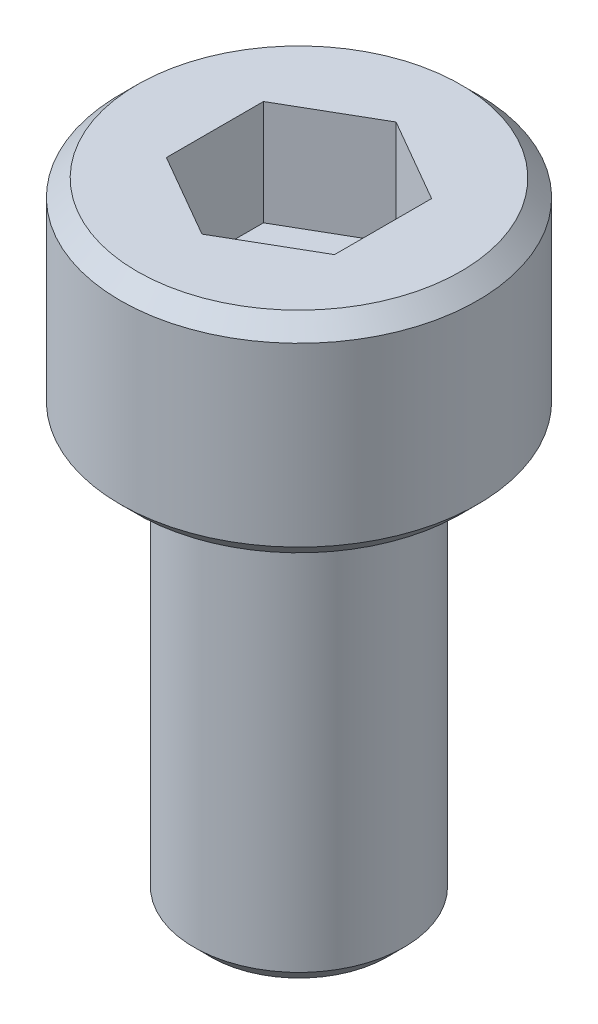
ISO-10303-21;
HEADER;
FILE_DESCRIPTION(('STEP AP214'),'2;1');
FILE_NAME('part.step','',(''),(''),'','','');
FILE_SCHEMA(('AUTOMOTIVE_DESIGN { 1 0 10303 214 1 1 1 1 }'));
ENDSEC;
DATA;
#1=APPLICATION_CONTEXT('core data for automotive mechanical design processes');
#2=APPLICATION_PROTOCOL_DEFINITION('international standard','automotive_design',2000,#1);
#3=PRODUCT_CONTEXT('',#1,'mechanical');
#4=PRODUCT('Part','Part','',(#3));
#5=PRODUCT_RELATED_PRODUCT_CATEGORY('part','',(#4));
#6=PRODUCT_DEFINITION_FORMATION('','',#4);
#7=PRODUCT_DEFINITION_CONTEXT('part definition',#1,'design');
#8=PRODUCT_DEFINITION('design','',#6,#7);
#9=PRODUCT_DEFINITION_SHAPE('','',#8);
#10=(LENGTH_UNIT() NAMED_UNIT(*) SI_UNIT(.MILLI.,.METRE.));
#11=(NAMED_UNIT(*) PLANE_ANGLE_UNIT() SI_UNIT($,.RADIAN.));
#12=(NAMED_UNIT(*) SI_UNIT($,.STERADIAN.) SOLID_ANGLE_UNIT());
#13=UNCERTAINTY_MEASURE_WITH_UNIT(LENGTH_MEASURE(1.E-05),#10,'distance_accuracy_value','');
#14=(GEOMETRIC_REPRESENTATION_CONTEXT(3) GLOBAL_UNCERTAINTY_ASSIGNED_CONTEXT((#13)) GLOBAL_UNIT_ASSIGNED_CONTEXT((#10,
#11,#12)) REPRESENTATION_CONTEXT('',''));
#15=CARTESIAN_POINT('',(0.,0.,0.));
#16=DIRECTION('',(0.,0.,1.));
#17=DIRECTION('',(1.,0.,0.));
#18=AXIS2_PLACEMENT_3D('',#15,#16,#17);
#19=CARTESIAN_POINT('',(4.25,15.0000000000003,0.));
#20=DIRECTION('',(0.,1.,0.));
#21=DIRECTION('',(0.,0.,1.00000000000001));
#22=AXIS2_PLACEMENT_3D('',#19,#20,#21);
#23=PLANE('',#22);
#24=DIRECTION('',(0.866025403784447,0.,-0.500000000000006));
#25=VECTOR('',#24,1.);
#26=CARTESIAN_POINT('',(0.,15.0000000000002,2.30940107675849));
#27=LINE('',#26,#25);
#28=CARTESIAN_POINT('',(0.,15.0000000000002,2.30940107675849));
#29=VERTEX_POINT('',#28);
#30=CARTESIAN_POINT('',(2.00000000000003,15.0000000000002,1.15470053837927));
#31=VERTEX_POINT('',#30);
#32=EDGE_CURVE('E52',#29,#31,#27,.T.);
#33=ORIENTED_EDGE('',*,*,#32,.F.);
#34=DIRECTION('',(0.866025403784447,0.,0.500000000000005));
#35=VECTOR('',#34,1.);
#36=CARTESIAN_POINT('',(-2.00000000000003,14.9999999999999,1.15470053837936));
#37=LINE('',#36,#35);
#38=CARTESIAN_POINT('',(-2.00000000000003,14.9999999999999,1.15470053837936));
#39=VERTEX_POINT('',#38);
#40=EDGE_CURVE('E121',#39,#29,#37,.T.);
#41=ORIENTED_EDGE('',*,*,#40,.F.);
#42=DIRECTION('',(0.,0.,1.00000000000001));
#43=VECTOR('',#42,1.);
#44=CARTESIAN_POINT('',(-2.00000000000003,15.0000000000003,-1.1547005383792));
#45=LINE('',#44,#43);
#46=CARTESIAN_POINT('',(-2.00000000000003,15.0000000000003,-1.1547005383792));
#47=VERTEX_POINT('',#46);
#48=EDGE_CURVE('E115',#47,#39,#45,.T.);
#49=ORIENTED_EDGE('',*,*,#48,.F.);
#50=DIRECTION('',(-0.866025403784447,0.,0.500000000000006));
#51=VECTOR('',#50,1.);
#52=CARTESIAN_POINT('',(0.,15.,-2.30940107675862));
#53=LINE('',#52,#51);
#54=CARTESIAN_POINT('',(0.,15.,-2.30940107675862));
#55=VERTEX_POINT('',#54);
#56=EDGE_CURVE('E113',#55,#47,#53,.T.);
#57=ORIENTED_EDGE('',*,*,#56,.F.);
#58=DIRECTION('',(-0.866025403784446,0.,-0.500000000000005));
#59=VECTOR('',#58,1.);
#60=CARTESIAN_POINT('',(2.00000000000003,15.,-1.15470053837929));
#61=LINE('',#60,#59);
#62=CARTESIAN_POINT('',(2.00000000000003,15.,-1.15470053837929));
#63=VERTEX_POINT('',#62);
#64=EDGE_CURVE('E95',#63,#55,#61,.T.);
#65=ORIENTED_EDGE('',*,*,#64,.F.);
#66=DIRECTION('',(0.,0.,-1.00000000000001));
#67=VECTOR('',#66,1.);
#68=CARTESIAN_POINT('',(2.00000000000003,15.0000000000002,1.15470053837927));
#69=LINE('',#68,#67);
#70=EDGE_CURVE('E106',#31,#63,#69,.T.);
#71=ORIENTED_EDGE('',*,*,#70,.F.);
#72=EDGE_LOOP('',(#33,#41,#49,#57,#65,#71));
#73=FACE_BOUND('',#72,.T.);
#74=CARTESIAN_POINT('',(0.,15.,0.));
#75=DIRECTION('',(0.,1.,0.));
#76=DIRECTION('',(0.,0.,1.00000000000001));
#77=AXIS2_PLACEMENT_3D('',#74,#75,#76);
#78=CIRCLE('',#77,3.85);
#79=CARTESIAN_POINT('',(0.,15.,3.85000000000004));
#80=VERTEX_POINT('',#79);
#81=EDGE_CURVE('E154',#80,#80,#78,.T.);
#82=ORIENTED_EDGE('',*,*,#81,.T.);
#83=EDGE_LOOP('',(#82));
#84=FACE_BOUND('',#83,.T.);
#85=ADVANCED_FACE('F38',(#73,#84),#23,.T.);
#86=CARTESIAN_POINT('',(0.,0.,0.));
#87=DIRECTION('',(0.,-1.,0.));
#88=DIRECTION('',(0.,0.,-1.00000000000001));
#89=AXIS2_PLACEMENT_3D('',#86,#87,#88);
#90=CYLINDRICAL_SURFACE('',#89,4.25);
#91=CARTESIAN_POINT('',(-1.38777878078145E-13,14.5999999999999,0.));
#92=DIRECTION('',(0.,1.,0.));
#93=DIRECTION('',(0.,0.,1.00000000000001));
#94=AXIS2_PLACEMENT_3D('',#91,#92,#93);
#95=CIRCLE('',#94,4.25);
#96=CARTESIAN_POINT('',(-1.38541955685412E-13,14.5999999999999,4.25000000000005));
#97=VERTEX_POINT('',#96);
#98=EDGE_CURVE('E151',#97,#97,#95,.F.);
#99=ORIENTED_EDGE('',*,*,#98,.T.);
#100=EDGE_LOOP('',(#99));
#101=FACE_BOUND('',#100,.T.);
#102=CARTESIAN_POINT('',(0.,10.3999999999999,0.));
#103=DIRECTION('',(0.,-1.,0.));
#104=DIRECTION('',(0.,0.,-1.00000000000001));
#105=AXIS2_PLACEMENT_3D('',#102,#103,#104);
#106=CIRCLE('',#105,4.25);
#107=CARTESIAN_POINT('',(0.,10.3999999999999,-4.25000000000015));
#108=VERTEX_POINT('',#107);
#109=EDGE_CURVE('E148',#108,#108,#106,.F.);
#110=ORIENTED_EDGE('',*,*,#109,.T.);
#111=EDGE_LOOP('',(#110));
#112=FACE_BOUND('',#111,.T.);
#113=ADVANCED_FACE('F181',(#101,#112),#90,.T.);
#114=CARTESIAN_POINT('',(2.49999999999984,10.0000000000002,0.));
#115=DIRECTION('',(0.,-1.,0.));
#116=DIRECTION('',(0.,0.,-1.00000000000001));
#117=AXIS2_PLACEMENT_3D('',#114,#115,#116);
#118=PLANE('',#117);
#119=CARTESIAN_POINT('',(0.,10.,2.08166817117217E-13));
#120=DIRECTION('',(0.,-1.,0.));
#121=DIRECTION('',(0.,0.,-1.00000000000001));
#122=AXIS2_PLACEMENT_3D('',#119,#120,#121);
#123=CIRCLE('',#122,3.85);
#124=CARTESIAN_POINT('',(0.,10.,-3.84999999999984));
#125=VERTEX_POINT('',#124);
#126=EDGE_CURVE('E157',#125,#125,#123,.T.);
#127=ORIENTED_EDGE('',*,*,#126,.T.);
#128=EDGE_LOOP('',(#127));
#129=FACE_BOUND('',#128,.T.);
#130=CARTESIAN_POINT('',(0.,10.,2.08166817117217E-13));
#131=DIRECTION('',(0.,-1.,0.));
#132=DIRECTION('',(0.,0.,-1.00000000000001));
#133=AXIS2_PLACEMENT_3D('',#130,#131,#132);
#134=CIRCLE('',#133,2.5);
#135=CARTESIAN_POINT('',(0.,10.,-2.49999999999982));
#136=VERTEX_POINT('',#135);
#137=EDGE_CURVE('E139',#136,#136,#134,.T.);
#138=ORIENTED_EDGE('',*,*,#137,.F.);
#139=EDGE_LOOP('',(#138));
#140=FACE_BOUND('',#139,.T.);
#141=ADVANCED_FACE('F185',(#129,#140),#118,.T.);
#142=CARTESIAN_POINT('',(0.,0.,0.));
#143=DIRECTION('',(0.,-1.,0.));
#144=DIRECTION('',(0.,0.,-1.00000000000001));
#145=AXIS2_PLACEMENT_3D('',#142,#143,#144);
#146=CYLINDRICAL_SURFACE('',#145,2.5);
#147=CARTESIAN_POINT('',(0.,0.400000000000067,0.));
#148=DIRECTION('',(0.,-1.,0.));
#149=DIRECTION('',(0.,0.,-1.00000000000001));
#150=AXIS2_PLACEMENT_3D('',#147,#148,#149);
#151=CIRCLE('',#150,2.5);
#152=CARTESIAN_POINT('',(0.,0.400000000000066,-2.50000000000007));
#153=VERTEX_POINT('',#152);
#154=EDGE_CURVE('E11',#153,#153,#151,.F.);
#155=ORIENTED_EDGE('',*,*,#154,.T.);
#156=EDGE_LOOP('',(#155));
#157=FACE_BOUND('',#156,.T.);
#158=ORIENTED_EDGE('',*,*,#137,.T.);
#159=EDGE_LOOP('',(#158));
#160=FACE_BOUND('',#159,.T.);
#161=ADVANCED_FACE('F190',(#157,#160),#146,.T.);
#162=CARTESIAN_POINT('',(0.,0.,0.));
#163=DIRECTION('',(0.,-1.,0.));
#164=DIRECTION('',(0.,0.,-1.00000000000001));
#165=AXIS2_PLACEMENT_3D('',#162,#163,#164);
#166=PLANE('',#165);
#167=CARTESIAN_POINT('',(0.,0.,0.));
#168=DIRECTION('',(0.,-1.,0.));
#169=DIRECTION('',(0.,0.,-1.00000000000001));
#170=AXIS2_PLACEMENT_3D('',#167,#168,#169);
#171=CIRCLE('',#170,2.1);
#172=CARTESIAN_POINT('',(0.,0.,-2.10000000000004));
#173=VERTEX_POINT('',#172);
#174=EDGE_CURVE('E45',#173,#173,#171,.T.);
#175=ORIENTED_EDGE('',*,*,#174,.T.);
#176=EDGE_LOOP('',(#175));
#177=FACE_BOUND('',#176,.T.);
#178=ADVANCED_FACE('F162',(#177),#166,.T.);
#179=CARTESIAN_POINT('',(-1.38777878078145E-13,14.5999999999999,0.));
#180=DIRECTION('',(0.,-1.,0.));
#181=DIRECTION('',(0.,0.,-1.00000000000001));
#182=AXIS2_PLACEMENT_3D('',#179,#180,#181);
#183=CONICAL_SURFACE('',#182,4.25,0.785398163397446);
#184=ORIENTED_EDGE('',*,*,#81,.F.);
#185=EDGE_LOOP('',(#184));
#186=FACE_BOUND('',#185,.T.);
#187=ORIENTED_EDGE('',*,*,#98,.F.);
#188=EDGE_LOOP('',(#187));
#189=FACE_BOUND('',#188,.T.);
#190=ADVANCED_FACE('F176',(#186,#189),#183,.T.);
#191=CARTESIAN_POINT('',(0.,10.,2.08166817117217E-13));
#192=DIRECTION('',(0.,1.,0.));
#193=DIRECTION('',(0.,0.,1.00000000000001));
#194=AXIS2_PLACEMENT_3D('',#191,#192,#193);
#195=CONICAL_SURFACE('',#194,3.85,0.785398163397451);
#196=ORIENTED_EDGE('',*,*,#109,.F.);
#197=EDGE_LOOP('',(#196));
#198=FACE_BOUND('',#197,.T.);
#199=ORIENTED_EDGE('',*,*,#126,.F.);
#200=EDGE_LOOP('',(#199));
#201=FACE_BOUND('',#200,.T.);
#202=ADVANCED_FACE('F167',(#198,#201),#195,.T.);
#203=CARTESIAN_POINT('',(0.,0.,0.));
#204=DIRECTION('',(0.,1.,0.));
#205=DIRECTION('',(0.,0.,1.00000000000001));
#206=AXIS2_PLACEMENT_3D('',#203,#204,#205);
#207=CONICAL_SURFACE('',#206,2.1,0.785398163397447);
#208=ORIENTED_EDGE('',*,*,#154,.F.);
#209=EDGE_LOOP('',(#208));
#210=FACE_BOUND('',#209,.T.);
#211=ORIENTED_EDGE('',*,*,#174,.F.);
#212=EDGE_LOOP('',(#211));
#213=FACE_BOUND('',#212,.T.);
#214=ADVANCED_FACE('F164',(#210,#213),#207,.T.);
#215=CARTESIAN_POINT('',(0.,12.5000000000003,2.30940107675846));
#216=DIRECTION('',(0.500000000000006,0.,0.866025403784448));
#217=DIRECTION('',(0.866025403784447,0.,-0.500000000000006));
#218=AXIS2_PLACEMENT_3D('',#215,#216,#217);
#219=PLANE('',#218);
#220=ORIENTED_EDGE('',*,*,#32,.T.);
#221=DIRECTION('',(0.,1.,0.));
#222=VECTOR('',#221,1.);
#223=CARTESIAN_POINT('',(2.00000000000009,12.5000000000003,1.15470053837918));
#224=LINE('',#223,#222);
#225=CARTESIAN_POINT('',(2.00000000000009,12.5000000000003,1.15470053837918));
#226=VERTEX_POINT('',#225);
#227=EDGE_CURVE('E103',#226,#31,#224,.T.);
#228=ORIENTED_EDGE('',*,*,#227,.F.);
#229=DIRECTION('',(0.866025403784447,0.,-0.500000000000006));
#230=VECTOR('',#229,1.);
#231=CARTESIAN_POINT('',(0.,12.5000000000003,2.30940107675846));
#232=LINE('',#231,#230);
#233=CARTESIAN_POINT('',(0.,12.5000000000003,2.30940107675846));
#234=VERTEX_POINT('',#233);
#235=EDGE_CURVE('E123',#234,#226,#232,.T.);
#236=ORIENTED_EDGE('',*,*,#235,.F.);
#237=DIRECTION('',(0.,1.,0.));
#238=VECTOR('',#237,1.);
#239=CARTESIAN_POINT('',(0.,12.5000000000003,2.30940107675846));
#240=LINE('',#239,#238);
#241=EDGE_CURVE('E59',#234,#29,#240,.T.);
#242=ORIENTED_EDGE('',*,*,#241,.T.);
#243=EDGE_LOOP('',(#220,#228,#236,#242));
#244=FACE_BOUND('',#243,.T.);
#245=ADVANCED_FACE('F166',(#244),#219,.F.);
#246=CARTESIAN_POINT('',(-2.00000000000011,12.5,1.1547005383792));
#247=DIRECTION('',(-0.500000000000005,0.,0.866025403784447));
#248=DIRECTION('',(0.866025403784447,0.,0.500000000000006));
#249=AXIS2_PLACEMENT_3D('',#246,#247,#248);
#250=PLANE('',#249);
#251=ORIENTED_EDGE('',*,*,#40,.T.);
#252=ORIENTED_EDGE('',*,*,#241,.F.);
#253=DIRECTION('',(0.866025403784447,0.,0.500000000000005));
#254=VECTOR('',#253,1.);
#255=CARTESIAN_POINT('',(-2.00000000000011,12.5,1.1547005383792));
#256=LINE('',#255,#254);
#257=CARTESIAN_POINT('',(-2.00000000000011,12.5,1.1547005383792));
#258=VERTEX_POINT('',#257);
#259=EDGE_CURVE('E135',#258,#234,#256,.T.);
#260=ORIENTED_EDGE('',*,*,#259,.F.);
#261=DIRECTION('',(0.,1.,0.));
#262=VECTOR('',#261,1.);
#263=CARTESIAN_POINT('',(-2.00000000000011,12.5,1.1547005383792));
#264=LINE('',#263,#262);
#265=EDGE_CURVE('E140',#258,#39,#264,.T.);
#266=ORIENTED_EDGE('',*,*,#265,.T.);
#267=EDGE_LOOP('',(#251,#252,#260,#266));
#268=FACE_BOUND('',#267,.T.);
#269=ADVANCED_FACE('F174',(#268),#250,.F.);
#270=CARTESIAN_POINT('',(-2.00000000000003,12.5000000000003,-1.1547005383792));
#271=DIRECTION('',(-1.00000000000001,0.,0.));
#272=DIRECTION('',(0.,0.,1.00000000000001));
#273=AXIS2_PLACEMENT_3D('',#270,#271,#272);
#274=PLANE('',#273);
#275=ORIENTED_EDGE('',*,*,#48,.T.);
#276=ORIENTED_EDGE('',*,*,#265,.F.);
#277=DIRECTION('',(0.,0.,1.00000000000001));
#278=VECTOR('',#277,1.);
#279=CARTESIAN_POINT('',(-2.00000000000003,12.5000000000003,-1.1547005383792));
#280=LINE('',#279,#278);
#281=CARTESIAN_POINT('',(-2.00000000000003,12.5000000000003,-1.1547005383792));
#282=VERTEX_POINT('',#281);
#283=EDGE_CURVE('E132',#282,#258,#280,.T.);
#284=ORIENTED_EDGE('',*,*,#283,.F.);
#285=DIRECTION('',(0.,1.,0.));
#286=VECTOR('',#285,1.);
#287=CARTESIAN_POINT('',(-2.00000000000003,12.5000000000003,-1.1547005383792));
#288=LINE('',#287,#286);
#289=EDGE_CURVE('E142',#282,#47,#288,.T.);
#290=ORIENTED_EDGE('',*,*,#289,.T.);
#291=EDGE_LOOP('',(#275,#276,#284,#290));
#292=FACE_BOUND('',#291,.T.);
#293=ADVANCED_FACE('F232',(#292),#274,.F.);
#294=CARTESIAN_POINT('',(0.,12.5,-2.3094010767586));
#295=DIRECTION('',(-0.500000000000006,0.,-0.866025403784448));
#296=DIRECTION('',(-0.866025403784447,0.,0.500000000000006));
#297=AXIS2_PLACEMENT_3D('',#294,#295,#296);
#298=PLANE('',#297);
#299=ORIENTED_EDGE('',*,*,#56,.T.);
#300=ORIENTED_EDGE('',*,*,#289,.F.);
#301=DIRECTION('',(-0.866025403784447,0.,0.500000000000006));
#302=VECTOR('',#301,1.);
#303=CARTESIAN_POINT('',(0.,12.5,-2.3094010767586));
#304=LINE('',#303,#302);
#305=CARTESIAN_POINT('',(0.,12.5,-2.3094010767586));
#306=VERTEX_POINT('',#305);
#307=EDGE_CURVE('E129',#306,#282,#304,.T.);
#308=ORIENTED_EDGE('',*,*,#307,.F.);
#309=DIRECTION('',(0.,1.,0.));
#310=VECTOR('',#309,1.);
#311=CARTESIAN_POINT('',(0.,12.5,-2.3094010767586));
#312=LINE('',#311,#310);
#313=EDGE_CURVE('E102',#306,#55,#312,.T.);
#314=ORIENTED_EDGE('',*,*,#313,.T.);
#315=EDGE_LOOP('',(#299,#300,#308,#314));
#316=FACE_BOUND('',#315,.T.);
#317=ADVANCED_FACE('F241',(#316),#298,.F.);
#318=CARTESIAN_POINT('',(2.00000000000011,12.5000000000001,-1.15470053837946));
#319=DIRECTION('',(0.500000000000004,0.,-0.866025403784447));
#320=DIRECTION('',(-0.866025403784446,0.,-0.500000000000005));
#321=AXIS2_PLACEMENT_3D('',#318,#319,#320);
#322=PLANE('',#321);
#323=ORIENTED_EDGE('',*,*,#64,.T.);
#324=ORIENTED_EDGE('',*,*,#313,.F.);
#325=DIRECTION('',(-0.866025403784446,0.,-0.500000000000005));
#326=VECTOR('',#325,1.);
#327=CARTESIAN_POINT('',(2.00000000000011,12.5000000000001,-1.15470053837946));
#328=LINE('',#327,#326);
#329=CARTESIAN_POINT('',(2.00000000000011,12.5000000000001,-1.15470053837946));
#330=VERTEX_POINT('',#329);
#331=EDGE_CURVE('E98',#330,#306,#328,.T.);
#332=ORIENTED_EDGE('',*,*,#331,.F.);
#333=DIRECTION('',(0.,1.,0.));
#334=VECTOR('',#333,1.);
#335=CARTESIAN_POINT('',(2.00000000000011,12.5000000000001,-1.15470053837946));
#336=LINE('',#335,#334);
#337=EDGE_CURVE('E91',#330,#63,#336,.T.);
#338=ORIENTED_EDGE('',*,*,#337,.T.);
#339=EDGE_LOOP('',(#323,#324,#332,#338));
#340=FACE_BOUND('',#339,.T.);
#341=ADVANCED_FACE('F93',(#340),#322,.F.);
#342=CARTESIAN_POINT('',(2.00000000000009,12.5000000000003,1.15470053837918));
#343=DIRECTION('',(1.00000000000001,0.,0.));
#344=DIRECTION('',(0.,0.,-1.00000000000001));
#345=AXIS2_PLACEMENT_3D('',#342,#343,#344);
#346=PLANE('',#345);
#347=ORIENTED_EDGE('',*,*,#70,.T.);
#348=ORIENTED_EDGE('',*,*,#337,.F.);
#349=DIRECTION('',(0.,0.,-1.00000000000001));
#350=VECTOR('',#349,1.);
#351=CARTESIAN_POINT('',(2.00000000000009,12.5000000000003,1.15470053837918));
#352=LINE('',#351,#350);
#353=EDGE_CURVE('E126',#226,#330,#352,.T.);
#354=ORIENTED_EDGE('',*,*,#353,.F.);
#355=ORIENTED_EDGE('',*,*,#227,.T.);
#356=EDGE_LOOP('',(#347,#348,#354,#355));
#357=FACE_BOUND('',#356,.T.);
#358=ADVANCED_FACE('F107',(#357),#346,.F.);
#359=CARTESIAN_POINT('',(4.00000000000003,12.5000000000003,0.));
#360=DIRECTION('',(0.,1.,0.));
#361=DIRECTION('',(0.,0.,1.00000000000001));
#362=AXIS2_PLACEMENT_3D('',#359,#360,#361);
#363=PLANE('',#362);
#364=ORIENTED_EDGE('',*,*,#235,.T.);
#365=ORIENTED_EDGE('',*,*,#353,.T.);
#366=ORIENTED_EDGE('',*,*,#331,.T.);
#367=ORIENTED_EDGE('',*,*,#307,.T.);
#368=ORIENTED_EDGE('',*,*,#283,.T.);
#369=ORIENTED_EDGE('',*,*,#259,.T.);
#370=EDGE_LOOP('',(#364,#365,#366,#367,#368,#369));
#371=FACE_BOUND('',#370,.T.);
#372=ADVANCED_FACE('F268',(#371),#363,.T.);
#373=CLOSED_SHELL('',(#85,#113,#141,#161,#178,#190,#202,#214,#245,#269,#293,#317,#341,#358,#372));
#374=MANIFOLD_SOLID_BREP('B2',#373);
#375=ADVANCED_BREP_SHAPE_REPRESENTATION('',(#18,#374),#14);
#376=SHAPE_DEFINITION_REPRESENTATION(#9,#375);
ENDSEC;
END-ISO-10303-21;
